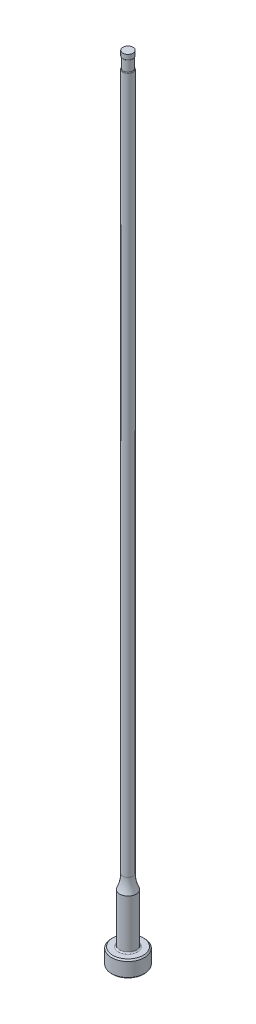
ISO-10303-21;
HEADER;
FILE_DESCRIPTION(('STEP AP214'),'2;1');
FILE_NAME('part.step','',(''),(''),'','','');
FILE_SCHEMA(('AUTOMOTIVE_DESIGN { 1 0 10303 214 1 1 1 1 }'));
ENDSEC;
DATA;
#1=APPLICATION_CONTEXT('core data for automotive mechanical design processes');
#2=APPLICATION_PROTOCOL_DEFINITION('international standard','automotive_design',2000,#1);
#3=PRODUCT_CONTEXT('',#1,'mechanical');
#4=PRODUCT('Part','Part','',(#3));
#5=PRODUCT_RELATED_PRODUCT_CATEGORY('part','',(#4));
#6=PRODUCT_DEFINITION_FORMATION('','',#4);
#7=PRODUCT_DEFINITION_CONTEXT('part definition',#1,'design');
#8=PRODUCT_DEFINITION('design','',#6,#7);
#9=PRODUCT_DEFINITION_SHAPE('','',#8);
#10=(LENGTH_UNIT() NAMED_UNIT(*) SI_UNIT(.MILLI.,.METRE.));
#11=(NAMED_UNIT(*) PLANE_ANGLE_UNIT() SI_UNIT($,.RADIAN.));
#12=(NAMED_UNIT(*) SI_UNIT($,.STERADIAN.) SOLID_ANGLE_UNIT());
#13=UNCERTAINTY_MEASURE_WITH_UNIT(LENGTH_MEASURE(1.E-05),#10,'distance_accuracy_value','');
#14=(GEOMETRIC_REPRESENTATION_CONTEXT(3) GLOBAL_UNCERTAINTY_ASSIGNED_CONTEXT((#13)) GLOBAL_UNIT_ASSIGNED_CONTEXT((#10,
#11,#12)) REPRESENTATION_CONTEXT('',''));
#15=CARTESIAN_POINT('',(0.,0.,0.));
#16=DIRECTION('',(0.,0.,1.));
#17=DIRECTION('',(1.,0.,0.));
#18=AXIS2_PLACEMENT_3D('',#15,#16,#17);
#19=CARTESIAN_POINT('',(0.,259.958771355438,0.));
#20=DIRECTION('',(0.,1.,0.));
#21=DIRECTION('',(0.,0.,1.));
#22=AXIS2_PLACEMENT_3D('',#19,#20,#21);
#23=CYLINDRICAL_SURFACE('',#22,0.991869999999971);
#24=DIRECTION('',(0.,1.,0.));
#25=VECTOR('',#24,1.);
#26=CARTESIAN_POINT('',(-0.890269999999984,259.958771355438,-0.437293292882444));
#27=LINE('',#26,#25);
#28=CARTESIAN_POINT('',(-0.890269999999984,149.227565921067,-0.437293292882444));
#29=VERTEX_POINT('',#28);
#30=CARTESIAN_POINT('',(-0.890269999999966,112.268,-0.43729329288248));
#31=VERTEX_POINT('',#30);
#32=EDGE_CURVE('E66',#29,#31,#27,.F.);
#33=ORIENTED_EDGE('',*,*,#32,.F.);
#34=CARTESIAN_POINT('',(0.,149.227565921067,0.));
#35=DIRECTION('',(0.,1.,0.));
#36=DIRECTION('',(0.,0.,1.));
#37=AXIS2_PLACEMENT_3D('',#34,#35,#36);
#38=CIRCLE('',#37,0.991869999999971);
#39=CARTESIAN_POINT('',(-0.890269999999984,149.227565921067,0.437293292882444));
#40=VERTEX_POINT('',#39);
#41=EDGE_CURVE('E44',#29,#40,#38,.F.);
#42=ORIENTED_EDGE('',*,*,#41,.T.);
#43=DIRECTION('',(0.,1.,0.));
#44=VECTOR('',#43,1.);
#45=CARTESIAN_POINT('',(-0.890269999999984,259.958771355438,0.437293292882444));
#46=LINE('',#45,#44);
#47=CARTESIAN_POINT('',(-0.890269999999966,112.268,0.43729329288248));
#48=VERTEX_POINT('',#47);
#49=EDGE_CURVE('E72',#48,#40,#46,.T.);
#50=ORIENTED_EDGE('',*,*,#49,.F.);
#51=CARTESIAN_POINT('',(-0.890269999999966,112.268,-0.43729329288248));
#52=CARTESIAN_POINT('',(-0.890266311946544,112.234545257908,-0.437278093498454));
#53=CARTESIAN_POINT('',(-0.890798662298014,112.201083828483,-0.436215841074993));
#54=CARTESIAN_POINT('',(-0.89291221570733,112.1342670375,-0.431885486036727));
#55=CARTESIAN_POINT('',(-0.8944956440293,112.100912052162,-0.428612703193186));
#56=CARTESIAN_POINT('',(-0.898710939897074,112.034207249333,-0.419700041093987));
#57=CARTESIAN_POINT('',(-0.901354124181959,112.0008615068,-0.414034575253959));
#58=CARTESIAN_POINT('',(-0.907624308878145,111.934839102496,-0.400103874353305));
#59=CARTESIAN_POINT('',(-0.911250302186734,111.902161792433,-0.391841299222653));
#60=CARTESIAN_POINT('',(-0.919626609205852,111.835872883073,-0.371778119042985));
#61=CARTESIAN_POINT('',(-0.924431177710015,111.80232221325,-0.359795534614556));
#62=CARTESIAN_POINT('',(-0.934806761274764,111.73704822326,-0.331911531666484));
#63=CARTESIAN_POINT('',(-0.940375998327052,111.705320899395,-0.316019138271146));
#64=CARTESIAN_POINT('',(-0.950464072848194,111.652247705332,-0.283956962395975));
#65=CARTESIAN_POINT('',(-0.954903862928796,111.630269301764,-0.268819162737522));
#66=CARTESIAN_POINT('',(-0.963691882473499,111.588821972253,-0.235377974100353));
#67=CARTESIAN_POINT('',(-0.968040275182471,111.569348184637,-0.217080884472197));
#68=CARTESIAN_POINT('',(-0.974794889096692,111.540172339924,-0.183749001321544));
#69=CARTESIAN_POINT('',(-0.977361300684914,111.529390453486,-0.169697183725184));
#70=CARTESIAN_POINT('',(-0.982046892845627,111.510069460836,-0.140050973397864));
#71=CARTESIAN_POINT('',(-0.984166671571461,111.501527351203,-0.124458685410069));
#72=CARTESIAN_POINT('',(-0.987438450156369,111.488502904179,-0.0946420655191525));
#73=CARTESIAN_POINT('',(-0.988692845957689,111.483581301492,-0.080622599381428));
#74=CARTESIAN_POINT('',(-0.990613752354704,111.476085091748,-0.0519284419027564));
#75=CARTESIAN_POINT('',(-0.991280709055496,111.473508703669,-0.0372542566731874));
#76=CARTESIAN_POINT('',(-0.991951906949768,111.47091599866,-0.00760975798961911));
#77=CARTESIAN_POINT('',(-0.99195380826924,111.470908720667,0.00736141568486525));
#78=CARTESIAN_POINT('',(-0.991288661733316,111.473477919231,0.0370648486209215));
#79=CARTESIAN_POINT('',(-0.990621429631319,111.476055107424,0.0517970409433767));
#80=CARTESIAN_POINT('',(-0.988743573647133,111.483383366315,0.07988068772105));
#81=CARTESIAN_POINT('',(-0.987561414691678,111.488020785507,0.0932643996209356));
#82=CARTESIAN_POINT('',(-0.984768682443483,111.499124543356,0.119193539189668));
#83=CARTESIAN_POINT('',(-0.983157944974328,111.505591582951,0.131738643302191));
#84=CARTESIAN_POINT('',(-0.978661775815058,111.523953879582,0.162424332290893));
#85=CARTESIAN_POINT('',(-0.975558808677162,111.536890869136,0.179909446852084));
#86=CARTESIAN_POINT('',(-0.96896763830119,111.56532520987,0.212571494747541));
#87=CARTESIAN_POINT('',(-0.965478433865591,111.580829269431,0.227742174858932));
#88=CARTESIAN_POINT('',(-0.956293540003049,111.623332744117,0.264288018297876));
#89=CARTESIAN_POINT('',(-0.950512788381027,111.651709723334,0.284029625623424));
#90=CARTESIAN_POINT('',(-0.939335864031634,111.711144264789,0.319042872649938));
#91=CARTESIAN_POINT('',(-0.933940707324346,111.742208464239,0.334303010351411));
#92=CARTESIAN_POINT('',(-0.920397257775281,111.828246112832,0.370513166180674));
#93=CARTESIAN_POINT('',(-0.912954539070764,111.884778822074,0.388004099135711));
#94=CARTESIAN_POINT('',(-0.901068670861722,111.999979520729,0.414830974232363));
#95=CARTESIAN_POINT('',(-0.896628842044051,112.058649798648,0.424157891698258));
#96=CARTESIAN_POINT('',(-0.892643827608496,112.142710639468,0.432432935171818));
#97=CARTESIAN_POINT('',(-0.891752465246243,112.167788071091,0.434264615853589));
#98=CARTESIAN_POINT('',(-0.890566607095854,112.217908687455,0.43669067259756));
#99=CARTESIAN_POINT('',(-0.890269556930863,112.242951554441,0.437290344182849));
#100=CARTESIAN_POINT('',(-0.890269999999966,112.268,0.43729329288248));
#101=B_SPLINE_CURVE_WITH_KNOTS('',3,(#51,#52,#53,#54,#55,#56,#57,#58,#59,#60,#61,#62,#63,#64,
#65,#66,#67,#68,#69,#70,#71,#72,#73,#74,#75,#76,#77,#78,#79,#80,#81,#82,#83,#84,#85,#86,#87,#88,
#89,#90,#91,#92,#93,#94,#95,#96,#97,#98,#99,#100),.UNSPECIFIED.,.F.,.F.,(4,2,2,2,2,2,2,2,2,2,2,
2,2,2,2,2,2,2,2,2,2,2,2,2,4),(0.,0.10035396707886,0.200921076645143,0.302591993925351,
0.404159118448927,0.511798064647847,0.619190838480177,0.700138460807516,0.780926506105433,
0.834449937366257,0.887901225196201,0.93244760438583,0.976960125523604,1.02162925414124,
1.06631068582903,1.10878536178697,1.15127633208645,1.21681290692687,1.28252352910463,
1.38707795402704,1.49189842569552,1.66985552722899,1.84800909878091,1.92345875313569,
1.99858341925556),.UNSPECIFIED.);
#102=EDGE_CURVE('E74',#31,#48,#101,.T.);
#103=ORIENTED_EDGE('',*,*,#102,.F.);
#104=EDGE_LOOP('',(#33,#42,#50,#103));
#105=FACE_BOUND('',#104,.T.);
#106=CARTESIAN_POINT('',(0.,15.3850932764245,0.));
#107=DIRECTION('',(0.,1.,0.));
#108=DIRECTION('',(0.,0.,1.));
#109=AXIS2_PLACEMENT_3D('',#106,#107,#108);
#110=CIRCLE('',#109,0.991869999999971);
#111=CARTESIAN_POINT('',(0.,15.3850932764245,0.991869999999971));
#112=VERTEX_POINT('',#111);
#113=EDGE_CURVE('E95',#112,#112,#110,.T.);
#114=ORIENTED_EDGE('',*,*,#113,.T.);
#115=EDGE_LOOP('',(#114));
#116=FACE_BOUND('',#115,.T.);
#117=ADVANCED_FACE('F36',(#105,#116),#23,.T.);
#118=CARTESIAN_POINT('',(0.,15.3850932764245,0.));
#119=DIRECTION('',(0.,1.,0.));
#120=DIRECTION('',(0.,0.,1.));
#121=AXIS2_PLACEMENT_3D('',#118,#119,#120);
#122=TOROIDAL_SURFACE('',#121,7.34186999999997,6.35);
#123=CARTESIAN_POINT('',(0.,12.7,0.));
#124=DIRECTION('',(0.,1.,0.));
#125=DIRECTION('',(0.,0.,1.));
#126=AXIS2_PLACEMENT_3D('',#123,#124,#125);
#127=CIRCLE('',#126,1.58749999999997);
#128=CARTESIAN_POINT('',(0.,12.7,1.58749999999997));
#129=VERTEX_POINT('',#128);
#130=EDGE_CURVE('E92',#129,#129,#127,.T.);
#131=ORIENTED_EDGE('',*,*,#130,.T.);
#132=EDGE_LOOP('',(#131));
#133=FACE_BOUND('',#132,.T.);
#134=ORIENTED_EDGE('',*,*,#113,.F.);
#135=EDGE_LOOP('',(#134));
#136=FACE_BOUND('',#135,.T.);
#137=ADVANCED_FACE('F156',(#133,#136),#122,.F.);
#138=CARTESIAN_POINT('',(0.,259.958771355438,0.));
#139=DIRECTION('',(0.,1.,0.));
#140=DIRECTION('',(0.,0.,1.));
#141=AXIS2_PLACEMENT_3D('',#138,#139,#140);
#142=CYLINDRICAL_SURFACE('',#141,1.58749999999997);
#143=CARTESIAN_POINT('',(0.,3.42900000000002,0.));
#144=DIRECTION('',(0.,1.,0.));
#145=DIRECTION('',(0.,0.,1.));
#146=AXIS2_PLACEMENT_3D('',#143,#144,#145);
#147=CIRCLE('',#146,1.58749999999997);
#148=CARTESIAN_POINT('',(0.,3.42900000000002,1.58749999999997));
#149=VERTEX_POINT('',#148);
#150=EDGE_CURVE('E110',#149,#149,#147,.T.);
#151=ORIENTED_EDGE('',*,*,#150,.T.);
#152=EDGE_LOOP('',(#151));
#153=FACE_BOUND('',#152,.T.);
#154=ORIENTED_EDGE('',*,*,#130,.F.);
#155=EDGE_LOOP('',(#154));
#156=FACE_BOUND('',#155,.T.);
#157=ADVANCED_FACE('F153',(#153,#156),#142,.T.);
#158=CARTESIAN_POINT('',(-3.17499999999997,3.175,0.));
#159=DIRECTION('',(0.,1.,0.));
#160=DIRECTION('',(0.,0.,1.));
#161=AXIS2_PLACEMENT_3D('',#158,#159,#160);
#162=PLANE('',#161);
#163=CARTESIAN_POINT('',(0.,3.175,0.));
#164=DIRECTION('',(0.,1.,0.));
#165=DIRECTION('',(0.,0.,1.));
#166=AXIS2_PLACEMENT_3D('',#163,#164,#165);
#167=CIRCLE('',#166,1.84149999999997);
#168=CARTESIAN_POINT('',(0.,3.175,1.84149999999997));
#169=VERTEX_POINT('',#168);
#170=EDGE_CURVE('E78',#169,#169,#167,.F.);
#171=ORIENTED_EDGE('',*,*,#170,.T.);
#172=EDGE_LOOP('',(#171));
#173=FACE_BOUND('',#172,.T.);
#174=CARTESIAN_POINT('',(0.,3.175,0.));
#175=DIRECTION('',(0.,1.,0.));
#176=DIRECTION('',(0.,0.,1.));
#177=AXIS2_PLACEMENT_3D('',#174,#175,#176);
#178=CIRCLE('',#177,2.92099999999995);
#179=CARTESIAN_POINT('',(0.,3.175,2.92099999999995));
#180=VERTEX_POINT('',#179);
#181=EDGE_CURVE('E98',#180,#180,#178,.T.);
#182=ORIENTED_EDGE('',*,*,#181,.T.);
#183=EDGE_LOOP('',(#182));
#184=FACE_BOUND('',#183,.T.);
#185=ADVANCED_FACE('F149',(#173,#184),#162,.T.);
#186=CARTESIAN_POINT('',(0.,259.958771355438,0.));
#187=DIRECTION('',(0.,1.,0.));
#188=DIRECTION('',(0.,0.,1.));
#189=AXIS2_PLACEMENT_3D('',#186,#187,#188);
#190=CYLINDRICAL_SURFACE('',#189,3.17499999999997);
#191=CARTESIAN_POINT('',(0.,2.92100000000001,0.));
#192=DIRECTION('',(0.,1.,0.));
#193=DIRECTION('',(0.,0.,1.));
#194=AXIS2_PLACEMENT_3D('',#191,#192,#193);
#195=CIRCLE('',#194,3.17499999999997);
#196=CARTESIAN_POINT('',(0.,2.92100000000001,3.17499999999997));
#197=VERTEX_POINT('',#196);
#198=EDGE_CURVE('E104',#197,#197,#195,.F.);
#199=ORIENTED_EDGE('',*,*,#198,.T.);
#200=EDGE_LOOP('',(#199));
#201=FACE_BOUND('',#200,.T.);
#202=CARTESIAN_POINT('',(0.,0.254000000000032,0.));
#203=DIRECTION('',(0.,-1.,0.));
#204=DIRECTION('',(0.,0.,-1.));
#205=AXIS2_PLACEMENT_3D('',#202,#203,#204);
#206=CIRCLE('',#205,3.17499999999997);
#207=CARTESIAN_POINT('',(0.,0.254000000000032,-3.17499999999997));
#208=VERTEX_POINT('',#207);
#209=EDGE_CURVE('E101',#208,#208,#206,.F.);
#210=ORIENTED_EDGE('',*,*,#209,.T.);
#211=EDGE_LOOP('',(#210));
#212=FACE_BOUND('',#211,.T.);
#213=ADVANCED_FACE('F145',(#201,#212),#190,.T.);
#214=CARTESIAN_POINT('',(0.,0.,0.));
#215=DIRECTION('',(0.,-1.,0.));
#216=DIRECTION('',(0.,0.,-1.));
#217=AXIS2_PLACEMENT_3D('',#214,#215,#216);
#218=PLANE('',#217);
#219=CARTESIAN_POINT('',(0.,0.,0.));
#220=DIRECTION('',(0.,-1.,0.));
#221=DIRECTION('',(0.,0.,-1.));
#222=AXIS2_PLACEMENT_3D('',#219,#220,#221);
#223=CIRCLE('',#222,2.92099999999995);
#224=CARTESIAN_POINT('',(0.,0.,-2.92099999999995));
#225=VERTEX_POINT('',#224);
#226=EDGE_CURVE('E107',#225,#225,#223,.T.);
#227=ORIENTED_EDGE('',*,*,#226,.T.);
#228=EDGE_LOOP('',(#227));
#229=FACE_BOUND('',#228,.T.);
#230=ADVANCED_FACE('F141',(#229),#218,.T.);
#231=CARTESIAN_POINT('',(0.,3.17499999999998,0.));
#232=DIRECTION('',(0.,-1.,0.));
#233=DIRECTION('',(0.,0.,-1.));
#234=AXIS2_PLACEMENT_3D('',#231,#232,#233);
#235=CONICAL_SURFACE('',#234,2.92099999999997,0.7853981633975);
#236=ORIENTED_EDGE('',*,*,#198,.F.);
#237=EDGE_LOOP('',(#236));
#238=FACE_BOUND('',#237,.T.);
#239=ORIENTED_EDGE('',*,*,#181,.F.);
#240=EDGE_LOOP('',(#239));
#241=FACE_BOUND('',#240,.T.);
#242=ADVANCED_FACE('F144',(#238,#241),#235,.T.);
#243=CARTESIAN_POINT('',(0.,0.254000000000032,0.));
#244=DIRECTION('',(0.,1.,0.));
#245=DIRECTION('',(0.,0.,1.));
#246=AXIS2_PLACEMENT_3D('',#243,#244,#245);
#247=CONICAL_SURFACE('',#246,3.17499999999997,0.785398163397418);
#248=ORIENTED_EDGE('',*,*,#226,.F.);
#249=EDGE_LOOP('',(#248));
#250=FACE_BOUND('',#249,.T.);
#251=ORIENTED_EDGE('',*,*,#209,.F.);
#252=EDGE_LOOP('',(#251));
#253=FACE_BOUND('',#252,.T.);
#254=ADVANCED_FACE('F245',(#250,#253),#247,.T.);
#255=CARTESIAN_POINT('',(0.,3.42900000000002,0.));
#256=DIRECTION('',(0.,1.,0.));
#257=DIRECTION('',(0.,0.,1.));
#258=AXIS2_PLACEMENT_3D('',#255,#256,#257);
#259=TOROIDAL_SURFACE('',#258,1.84149999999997,0.254);
#260=ORIENTED_EDGE('',*,*,#170,.F.);
#261=EDGE_LOOP('',(#260));
#262=FACE_BOUND('',#261,.T.);
#263=ORIENTED_EDGE('',*,*,#150,.F.);
#264=EDGE_LOOP('',(#263));
#265=FACE_BOUND('',#264,.T.);
#266=ADVANCED_FACE('F139',(#262,#265),#259,.F.);
#267=CARTESIAN_POINT('',(0.,153.448281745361,0.));
#268=DIRECTION('',(0.,1.,0.));
#269=DIRECTION('',(0.,0.,1.));
#270=AXIS2_PLACEMENT_3D('',#267,#268,#269);
#271=CYLINDRICAL_SURFACE('',#270,0.890269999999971);
#272=CARTESIAN_POINT('',(0.,151.384,0.));
#273=DIRECTION('',(0.,1.,0.));
#274=DIRECTION('',(0.,0.,1.));
#275=AXIS2_PLACEMENT_3D('',#272,#273,#274);
#276=CIRCLE('',#275,0.890269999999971);
#277=CARTESIAN_POINT('',(0.,151.384,0.890269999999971));
#278=VERTEX_POINT('',#277);
#279=EDGE_CURVE('E71',#278,#278,#276,.T.);
#280=ORIENTED_EDGE('',*,*,#279,.F.);
#281=EDGE_LOOP('',(#280));
#282=FACE_BOUND('',#281,.T.);
#283=CARTESIAN_POINT('',(0.,149.352,0.));
#284=DIRECTION('',(0.,1.,0.));
#285=DIRECTION('',(0.,0.,1.));
#286=AXIS2_PLACEMENT_3D('',#283,#284,#285);
#287=CIRCLE('',#286,0.89026999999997);
#288=CARTESIAN_POINT('',(-0.890269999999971,149.352,0.));
#289=VERTEX_POINT('',#288);
#290=EDGE_CURVE('E89',#289,#289,#287,.T.);
#291=ORIENTED_EDGE('',*,*,#290,.T.);
#292=EDGE_LOOP('',(#291));
#293=FACE_BOUND('',#292,.T.);
#294=ADVANCED_FACE('F136',(#282,#293),#271,.T.);
#295=CARTESIAN_POINT('',(-0.890269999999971,150.368,-3.17499999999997));
#296=DIRECTION('',(1.,0.,0.));
#297=DIRECTION('',(0.,1.,0.));
#298=AXIS2_PLACEMENT_3D('',#295,#296,#297);
#299=PLANE('',#298);
#300=CARTESIAN_POINT('',(-0.890269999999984,149.227565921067,0.437293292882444));
#301=CARTESIAN_POINT('',(-0.890269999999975,149.230968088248,0.437301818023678));
#302=CARTESIAN_POINT('',(-0.890269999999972,149.234360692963,0.436983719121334));
#303=CARTESIAN_POINT('',(-0.890269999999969,149.241009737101,0.43576958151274));
#304=CARTESIAN_POINT('',(-0.89026999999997,149.244267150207,0.434878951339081));
#305=CARTESIAN_POINT('',(-0.890269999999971,149.250585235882,0.432596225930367));
#306=CARTESIAN_POINT('',(-0.890269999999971,149.253646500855,0.431205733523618));
#307=CARTESIAN_POINT('',(-0.89026999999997,149.259552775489,0.42801461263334));
#308=CARTESIAN_POINT('',(-0.89026999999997,149.262397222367,0.426212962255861));
#309=CARTESIAN_POINT('',(-0.89026999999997,149.269805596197,0.420882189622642));
#310=CARTESIAN_POINT('',(-0.89026999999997,149.27414344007,0.417039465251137));
#311=CARTESIAN_POINT('',(-0.89026999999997,149.282182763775,0.408741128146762));
#312=CARTESIAN_POINT('',(-0.89026999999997,149.285882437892,0.404283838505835));
#313=CARTESIAN_POINT('',(-0.89026999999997,149.2955289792,0.391183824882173));
#314=CARTESIAN_POINT('',(-0.89026999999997,149.300853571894,0.382087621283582));
#315=CARTESIAN_POINT('',(-0.89026999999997,149.310198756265,0.363263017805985));
#316=CARTESIAN_POINT('',(-0.89026999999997,149.314215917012,0.353533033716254));
#317=CARTESIAN_POINT('',(-0.89026999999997,149.323122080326,0.328598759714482));
#318=CARTESIAN_POINT('',(-0.89026999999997,149.32738200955,0.313173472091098));
#319=CARTESIAN_POINT('',(-0.89026999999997,149.334438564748,0.28198198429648));
#320=CARTESIAN_POINT('',(-0.89026999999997,149.337231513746,0.266215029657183));
#321=CARTESIAN_POINT('',(-0.89026999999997,149.344162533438,0.218503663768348));
#322=CARTESIAN_POINT('',(-0.89026999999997,149.346797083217,0.186351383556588));
#323=CARTESIAN_POINT('',(-0.89026999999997,149.349945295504,0.128280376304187));
#324=CARTESIAN_POINT('',(-0.89026999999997,149.35077238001,0.102368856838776));
#325=CARTESIAN_POINT('',(-0.89026999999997,149.351538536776,0.063707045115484));
#326=CARTESIAN_POINT('',(-0.89026999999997,149.351715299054,0.0509633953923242));
#327=CARTESIAN_POINT('',(-0.89026999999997,149.351944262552,0.0254795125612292));
#328=CARTESIAN_POINT('',(-0.89026999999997,149.351996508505,0.0127392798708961));
#329=CARTESIAN_POINT('',(-0.89026999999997,149.352000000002,1.16242336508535E-13));
#330=B_SPLINE_CURVE_WITH_KNOTS('',3,(#300,#301,#302,#303,#304,#305,#306,#307,#308,#309,#310,
#311,#312,#313,#314,#315,#316,#317,#318,#319,#320,#321,#322,#323,#324,#325,#326,#327,#328,#329),
.UNSPECIFIED.,.F.,.F.,(4,2,2,2,2,2,2,2,2,2,2,2,2,2,4),(0.,0.010176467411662,0.0202581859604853,
0.0303078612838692,0.0403827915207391,0.0576671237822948,0.0749995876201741,0.106441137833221,
0.137964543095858,0.185843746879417,0.233842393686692,0.330464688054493,0.408243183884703,
0.446476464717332,0.484696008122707),.UNSPECIFIED.);
#331=EDGE_CURVE('E77',#40,#289,#330,.T.);
#332=ORIENTED_EDGE('',*,*,#331,.T.);
#333=CARTESIAN_POINT('',(-0.89026999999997,149.352,0.));
#334=CARTESIAN_POINT('',(-0.89026999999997,149.351969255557,-0.0211447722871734));
#335=CARTESIAN_POINT('',(-0.89026999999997,149.351844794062,-0.0422938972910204));
#336=CARTESIAN_POINT('',(-0.89026999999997,149.351189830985,-0.0846467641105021));
#337=CARTESIAN_POINT('',(-0.89026999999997,149.350658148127,-0.105850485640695));
#338=CARTESIAN_POINT('',(-0.89026999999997,149.348965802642,-0.148284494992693));
#339=CARTESIAN_POINT('',(-0.89026999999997,149.34780367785,-0.169514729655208));
#340=CARTESIAN_POINT('',(-0.89026999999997,149.344394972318,-0.2118743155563));
#341=CARTESIAN_POINT('',(-0.89026999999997,149.342149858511,-0.233003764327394));
#342=CARTESIAN_POINT('',(-0.89026999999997,149.337358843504,-0.264920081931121));
#343=CARTESIAN_POINT('',(-0.89026999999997,149.335474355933,-0.275804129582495));
#344=CARTESIAN_POINT('',(-0.89026999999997,149.331051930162,-0.297473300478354));
#345=CARTESIAN_POINT('',(-0.89026999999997,149.328512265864,-0.308258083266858));
#346=CARTESIAN_POINT('',(-0.89026999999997,149.322067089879,-0.331438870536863));
#347=CARTESIAN_POINT('',(-0.89026999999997,149.318001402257,-0.343791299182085));
#348=CARTESIAN_POINT('',(-0.89026999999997,149.308220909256,-0.367815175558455));
#349=CARTESIAN_POINT('',(-0.89026999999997,149.302514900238,-0.379489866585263));
#350=CARTESIAN_POINT('',(-0.89026999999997,149.292928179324,-0.39462357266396));
#351=CARTESIAN_POINT('',(-0.89026999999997,149.290075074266,-0.39872901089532));
#352=CARTESIAN_POINT('',(-0.89026999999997,149.283937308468,-0.406618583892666));
#353=CARTESIAN_POINT('',(-0.89026999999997,149.28065209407,-0.410402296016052));
#354=CARTESIAN_POINT('',(-0.89026999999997,149.273554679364,-0.417536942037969));
#355=CARTESIAN_POINT('',(-0.89026999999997,149.269736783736,-0.420882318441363));
#356=CARTESIAN_POINT('',(-0.89026999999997,149.261570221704,-0.426851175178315));
#357=CARTESIAN_POINT('',(-0.89026999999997,149.257223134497,-0.429476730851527));
#358=CARTESIAN_POINT('',(-0.89026999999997,149.249577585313,-0.433007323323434));
#359=CARTESIAN_POINT('',(-0.89026999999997,149.246409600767,-0.434194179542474));
#360=CARTESIAN_POINT('',(-0.89026999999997,149.239923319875,-0.436020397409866));
#361=CARTESIAN_POINT('',(-0.89026999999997,149.236605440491,-0.436661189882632));
#362=CARTESIAN_POINT('',(-0.89026999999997,149.23136752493,-0.437197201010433));
#363=CARTESIAN_POINT('',(-0.89026999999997,149.229466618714,-0.437295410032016));
#364=CARTESIAN_POINT('',(-0.89026999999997,149.227565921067,-0.437293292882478));
#365=B_SPLINE_CURVE_WITH_KNOTS('',3,(#333,#334,#335,#336,#337,#338,#339,#340,#341,#342,#343,
#344,#345,#346,#347,#348,#349,#350,#351,#352,#353,#354,#355,#356,#357,#358,#359,#360,#361,#362,
#363,#364),.UNSPECIFIED.,.F.,.F.,(4,2,2,2,2,2,2,2,2,2,2,2,2,2,2,4),(0.,0.0634413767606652,
0.127067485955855,0.190841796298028,0.254529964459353,0.287653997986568,0.32086620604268,
0.359816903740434,0.398562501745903,0.413539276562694,0.428535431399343,0.443706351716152,
0.458833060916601,0.468942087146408,0.479024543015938,0.484725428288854),.UNSPECIFIED.);
#366=EDGE_CURVE('E58',#289,#29,#365,.T.);
#367=ORIENTED_EDGE('',*,*,#366,.T.);
#368=ORIENTED_EDGE('',*,*,#32,.T.);
#369=DIRECTION('',(0.,0.,1.));
#370=VECTOR('',#369,1.);
#371=CARTESIAN_POINT('',(-0.890269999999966,112.268,-3.17499999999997));
#372=LINE('',#371,#370);
#373=EDGE_CURVE('E70',#31,#48,#372,.T.);
#374=ORIENTED_EDGE('',*,*,#373,.T.);
#375=ORIENTED_EDGE('',*,*,#49,.T.);
#376=EDGE_LOOP('',(#332,#367,#368,#374,#375));
#377=FACE_BOUND('',#376,.T.);
#378=ADVANCED_FACE('F68',(#377),#299,.F.);
#379=CARTESIAN_POINT('',(-4.06526999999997,112.268,-3.17499999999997));
#380=DIRECTION('',(0.,0.,1.));
#381=DIRECTION('',(1.,0.,0.));
#382=AXIS2_PLACEMENT_3D('',#379,#380,#381);
#383=CYLINDRICAL_SURFACE('',#382,3.175);
#384=ORIENTED_EDGE('',*,*,#373,.F.);
#385=ORIENTED_EDGE('',*,*,#102,.T.);
#386=EDGE_LOOP('',(#384,#385));
#387=FACE_BOUND('',#386,.T.);
#388=ADVANCED_FACE('F80',(#387),#383,.F.);
#389=CARTESIAN_POINT('',(0.,152.687735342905,0.));
#390=DIRECTION('',(0.,1.,0.));
#391=DIRECTION('',(0.,0.,1.));
#392=AXIS2_PLACEMENT_3D('',#389,#390,#391);
#393=CYLINDRICAL_SURFACE('',#392,0.986789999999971);
#394=CARTESIAN_POINT('',(0.,151.507288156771,0.));
#395=DIRECTION('',(0.,-1.,0.));
#396=DIRECTION('',(0.,0.,-1.));
#397=AXIS2_PLACEMENT_3D('',#394,#395,#396);
#398=CIRCLE('',#397,0.986789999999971);
#399=CARTESIAN_POINT('',(0.,151.507288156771,-0.986789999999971));
#400=VERTEX_POINT('',#399);
#401=EDGE_CURVE('E11',#400,#400,#398,.F.);
#402=ORIENTED_EDGE('',*,*,#401,.T.);
#403=EDGE_LOOP('',(#402));
#404=FACE_BOUND('',#403,.T.);
#405=CARTESIAN_POINT('',(0.,152.4,0.));
#406=DIRECTION('',(0.,1.,0.));
#407=DIRECTION('',(0.,0.,1.));
#408=AXIS2_PLACEMENT_3D('',#405,#406,#407);
#409=CIRCLE('',#408,0.986789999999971);
#410=CARTESIAN_POINT('',(0.,152.4,0.986789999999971));
#411=VERTEX_POINT('',#410);
#412=EDGE_CURVE('E81',#411,#411,#409,.T.);
#413=ORIENTED_EDGE('',*,*,#412,.F.);
#414=EDGE_LOOP('',(#413));
#415=FACE_BOUND('',#414,.T.);
#416=ADVANCED_FACE('F133',(#404,#415),#393,.T.);
#417=CARTESIAN_POINT('',(-0.99186999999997,152.4,0.));
#418=DIRECTION('',(0.,1.,0.));
#419=DIRECTION('',(0.,0.,1.));
#420=AXIS2_PLACEMENT_3D('',#417,#418,#419);
#421=PLANE('',#420);
#422=ORIENTED_EDGE('',*,*,#412,.T.);
#423=EDGE_LOOP('',(#422));
#424=FACE_BOUND('',#423,.T.);
#425=ADVANCED_FACE('F177',(#424),#421,.T.);
#426=CARTESIAN_POINT('',(0.,149.227565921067,0.));
#427=DIRECTION('',(0.,1.,0.));
#428=DIRECTION('',(0.,0.,1.));
#429=AXIS2_PLACEMENT_3D('',#426,#427,#428);
#430=TOROIDAL_SURFACE('',#429,0.864869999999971,0.127);
#431=ORIENTED_EDGE('',*,*,#331,.F.);
#432=ORIENTED_EDGE('',*,*,#41,.F.);
#433=ORIENTED_EDGE('',*,*,#366,.F.);
#434=ORIENTED_EDGE('',*,*,#290,.F.);
#435=EDGE_LOOP('',(#431,#432,#433,#434));
#436=FACE_BOUND('',#435,.T.);
#437=ADVANCED_FACE('F209',(#436),#430,.T.);
#438=CARTESIAN_POINT('',(0.,151.507288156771,0.));
#439=DIRECTION('',(0.,-1.,0.));
#440=DIRECTION('',(0.,0.,-1.));
#441=AXIS2_PLACEMENT_3D('',#438,#439,#440);
#442=TOROIDAL_SURFACE('',#441,0.859789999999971,0.127);
#443=ORIENTED_EDGE('',*,*,#279,.T.);
#444=EDGE_LOOP('',(#443));
#445=FACE_BOUND('',#444,.T.);
#446=ORIENTED_EDGE('',*,*,#401,.F.);
#447=EDGE_LOOP('',(#446));
#448=FACE_BOUND('',#447,.T.);
#449=ADVANCED_FACE('F38',(#445,#448),#442,.T.);
#450=CLOSED_SHELL('',(#117,#137,#157,#185,#213,#230,#242,#254,#266,#294,#378,#388,#416,#425,
#437,#449));
#451=MANIFOLD_SOLID_BREP('B2',#450);
#452=ADVANCED_BREP_SHAPE_REPRESENTATION('',(#18,#451),#14);
#453=SHAPE_DEFINITION_REPRESENTATION(#9,#452);
ENDSEC;
END-ISO-10303-21;
